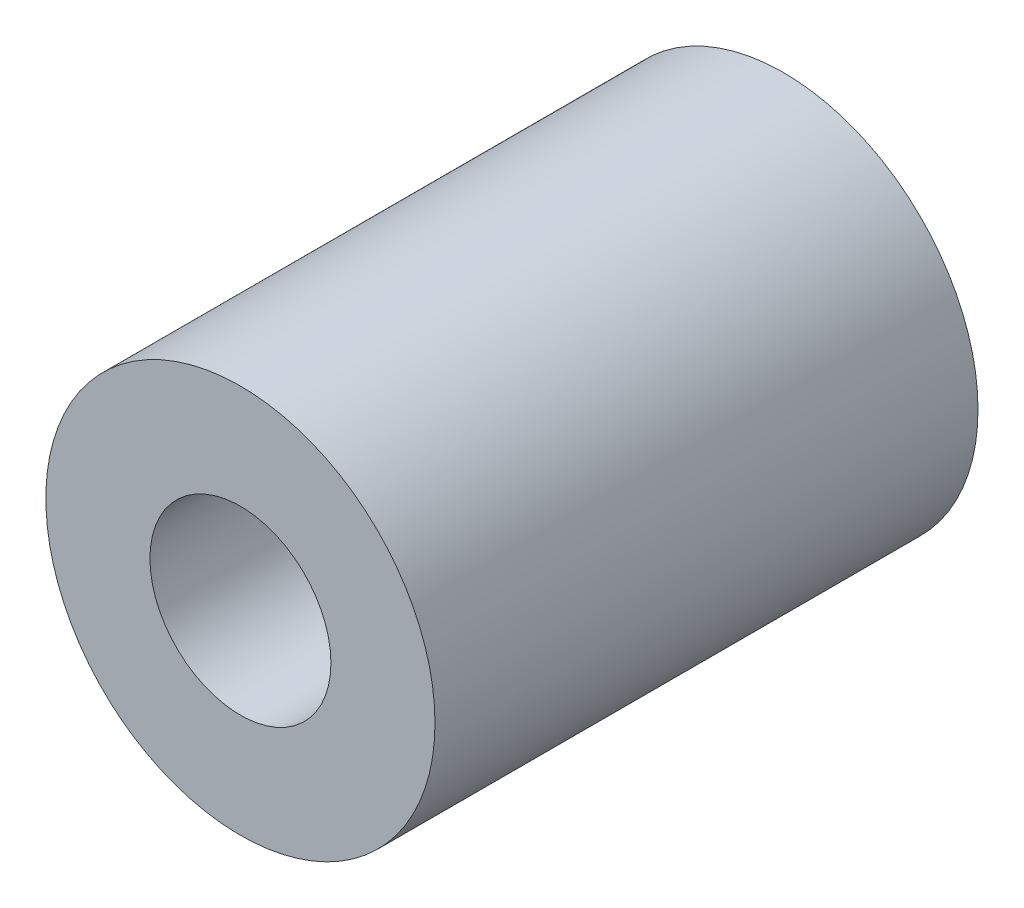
ISO-10303-21;
HEADER;
FILE_DESCRIPTION(('STEP AP214'),'2;1');
FILE_NAME('part.step','',(''),(''),'','','');
FILE_SCHEMA(('AUTOMOTIVE_DESIGN { 1 0 10303 214 1 1 1 1 }'));
ENDSEC;
DATA;
#1=APPLICATION_CONTEXT('core data for automotive mechanical design processes');
#2=APPLICATION_PROTOCOL_DEFINITION('international standard','automotive_design',2000,#1);
#3=PRODUCT_CONTEXT('',#1,'mechanical');
#4=PRODUCT('Part','Part','',(#3));
#5=PRODUCT_RELATED_PRODUCT_CATEGORY('part','',(#4));
#6=PRODUCT_DEFINITION_FORMATION('','',#4);
#7=PRODUCT_DEFINITION_CONTEXT('part definition',#1,'design');
#8=PRODUCT_DEFINITION('design','',#6,#7);
#9=PRODUCT_DEFINITION_SHAPE('','',#8);
#10=(LENGTH_UNIT() NAMED_UNIT(*) SI_UNIT(.MILLI.,.METRE.));
#11=(NAMED_UNIT(*) PLANE_ANGLE_UNIT() SI_UNIT($,.RADIAN.));
#12=(NAMED_UNIT(*) SI_UNIT($,.STERADIAN.) SOLID_ANGLE_UNIT());
#13=UNCERTAINTY_MEASURE_WITH_UNIT(LENGTH_MEASURE(1.E-05),#10,'distance_accuracy_value','');
#14=(GEOMETRIC_REPRESENTATION_CONTEXT(3) GLOBAL_UNCERTAINTY_ASSIGNED_CONTEXT((#13)) GLOBAL_UNIT_ASSIGNED_CONTEXT((#10,
#11,#12)) REPRESENTATION_CONTEXT('',''));
#15=CARTESIAN_POINT('',(0.,0.,0.));
#16=DIRECTION('',(0.,0.,1.));
#17=DIRECTION('',(1.,0.,0.));
#18=AXIS2_PLACEMENT_3D('',#15,#16,#17);
#19=CARTESIAN_POINT('',(0.,0.,6.));
#20=DIRECTION('',(0.,0.,1.));
#21=DIRECTION('',(1.,0.,0.));
#22=AXIS2_PLACEMENT_3D('',#19,#20,#21);
#23=PLANE('',#22);
#24=CARTESIAN_POINT('',(0.,0.,6.));
#25=DIRECTION('',(0.,0.,1.));
#26=DIRECTION('',(1.,0.,0.));
#27=AXIS2_PLACEMENT_3D('',#24,#25,#26);
#28=CIRCLE('',#27,2.15);
#29=CARTESIAN_POINT('',(2.15,0.,6.));
#30=VERTEX_POINT('',#29);
#31=EDGE_CURVE('E10',#30,#30,#28,.T.);
#32=ORIENTED_EDGE('',*,*,#31,.T.);
#33=EDGE_LOOP('',(#32));
#34=FACE_BOUND('',#33,.T.);
#35=CARTESIAN_POINT('',(0.,0.,6.));
#36=DIRECTION('',(0.,0.,1.));
#37=DIRECTION('',(1.,0.,0.));
#38=AXIS2_PLACEMENT_3D('',#35,#36,#37);
#39=CIRCLE('',#38,1.);
#40=CARTESIAN_POINT('',(1.,0.,6.));
#41=VERTEX_POINT('',#40);
#42=EDGE_CURVE('E39',#41,#41,#39,.T.);
#43=ORIENTED_EDGE('',*,*,#42,.F.);
#44=EDGE_LOOP('',(#43));
#45=FACE_BOUND('',#44,.T.);
#46=ADVANCED_FACE('F28',(#34,#45),#23,.T.);
#47=CARTESIAN_POINT('',(0.,0.,0.));
#48=DIRECTION('',(0.,0.,1.));
#49=DIRECTION('',(1.,0.,0.));
#50=AXIS2_PLACEMENT_3D('',#47,#48,#49);
#51=PLANE('',#50);
#52=CARTESIAN_POINT('',(0.,0.,0.));
#53=DIRECTION('',(0.,0.,1.));
#54=DIRECTION('',(1.,0.,0.));
#55=AXIS2_PLACEMENT_3D('',#52,#53,#54);
#56=CIRCLE('',#55,2.15);
#57=CARTESIAN_POINT('',(2.15,0.,0.));
#58=VERTEX_POINT('',#57);
#59=EDGE_CURVE('E32',#58,#58,#56,.T.);
#60=ORIENTED_EDGE('',*,*,#59,.F.);
#61=EDGE_LOOP('',(#60));
#62=FACE_BOUND('',#61,.T.);
#63=CARTESIAN_POINT('',(0.,0.,0.));
#64=DIRECTION('',(0.,0.,1.));
#65=DIRECTION('',(1.,0.,0.));
#66=AXIS2_PLACEMENT_3D('',#63,#64,#65);
#67=CIRCLE('',#66,1.);
#68=CARTESIAN_POINT('',(1.,0.,0.));
#69=VERTEX_POINT('',#68);
#70=EDGE_CURVE('E41',#69,#69,#67,.T.);
#71=ORIENTED_EDGE('',*,*,#70,.T.);
#72=EDGE_LOOP('',(#71));
#73=FACE_BOUND('',#72,.T.);
#74=ADVANCED_FACE('F51',(#62,#73),#51,.F.);
#75=CARTESIAN_POINT('',(0.,0.,6.));
#76=DIRECTION('',(0.,0.,-1.));
#77=DIRECTION('',(-1.,0.,0.));
#78=AXIS2_PLACEMENT_3D('',#75,#76,#77);
#79=CYLINDRICAL_SURFACE('',#78,2.15);
#80=ORIENTED_EDGE('',*,*,#31,.F.);
#81=EDGE_LOOP('',(#80));
#82=FACE_BOUND('',#81,.T.);
#83=ORIENTED_EDGE('',*,*,#59,.T.);
#84=EDGE_LOOP('',(#83));
#85=FACE_BOUND('',#84,.T.);
#86=ADVANCED_FACE('F30',(#82,#85),#79,.T.);
#87=CARTESIAN_POINT('',(0.,0.,6.));
#88=DIRECTION('',(0.,0.,-1.));
#89=DIRECTION('',(-1.,0.,0.));
#90=AXIS2_PLACEMENT_3D('',#87,#88,#89);
#91=CYLINDRICAL_SURFACE('',#90,1.);
#92=ORIENTED_EDGE('',*,*,#42,.T.);
#93=EDGE_LOOP('',(#92));
#94=FACE_BOUND('',#93,.T.);
#95=ORIENTED_EDGE('',*,*,#70,.F.);
#96=EDGE_LOOP('',(#95));
#97=FACE_BOUND('',#96,.T.);
#98=ADVANCED_FACE('F47',(#94,#97),#91,.F.);
#99=CLOSED_SHELL('',(#46,#74,#86,#98));
#100=MANIFOLD_SOLID_BREP('B2',#99);
#101=ADVANCED_BREP_SHAPE_REPRESENTATION('',(#18,#100),#14);
#102=SHAPE_DEFINITION_REPRESENTATION(#9,#101);
ENDSEC;
END-ISO-10303-21;
